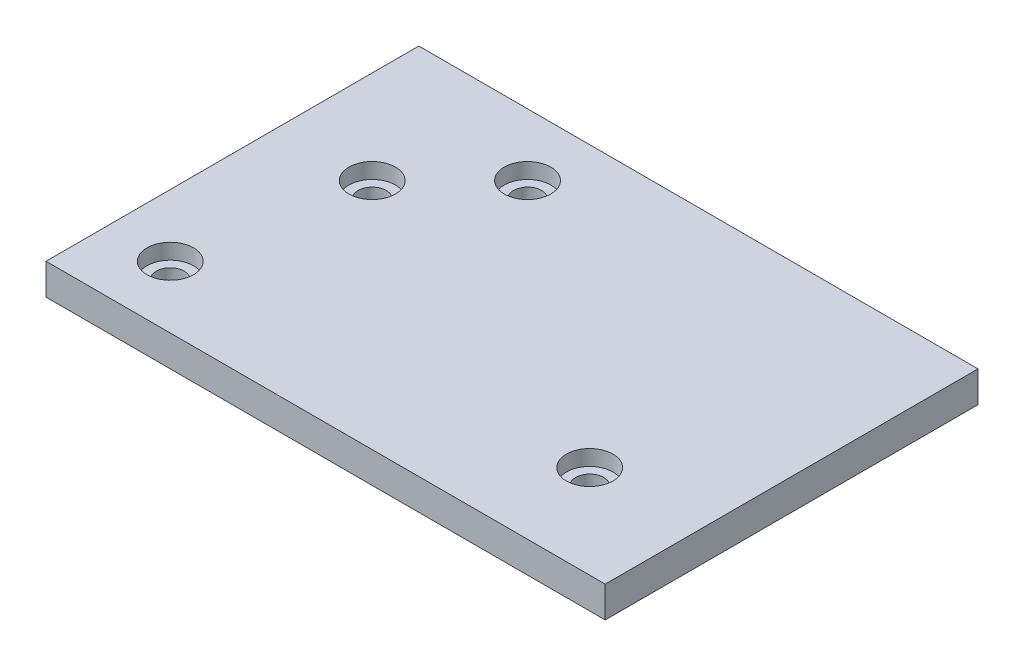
ISO-10303-21;
HEADER;
FILE_DESCRIPTION(('STEP AP214'),'2;1');
FILE_NAME('part.step','',(''),(''),'','','');
FILE_SCHEMA(('AUTOMOTIVE_DESIGN { 1 0 10303 214 1 1 1 1 }'));
ENDSEC;
DATA;
#1=APPLICATION_CONTEXT('core data for automotive mechanical design processes');
#2=APPLICATION_PROTOCOL_DEFINITION('international standard','automotive_design',2000,#1);
#3=PRODUCT_CONTEXT('',#1,'mechanical');
#4=PRODUCT('Part','Part','',(#3));
#5=PRODUCT_RELATED_PRODUCT_CATEGORY('part','',(#4));
#6=PRODUCT_DEFINITION_FORMATION('','',#4);
#7=PRODUCT_DEFINITION_CONTEXT('part definition',#1,'design');
#8=PRODUCT_DEFINITION('design','',#6,#7);
#9=PRODUCT_DEFINITION_SHAPE('','',#8);
#10=(LENGTH_UNIT() NAMED_UNIT(*) SI_UNIT(.MILLI.,.METRE.));
#11=(NAMED_UNIT(*) PLANE_ANGLE_UNIT() SI_UNIT($,.RADIAN.));
#12=(NAMED_UNIT(*) SI_UNIT($,.STERADIAN.) SOLID_ANGLE_UNIT());
#13=UNCERTAINTY_MEASURE_WITH_UNIT(LENGTH_MEASURE(1.E-05),#10,'distance_accuracy_value','');
#14=(GEOMETRIC_REPRESENTATION_CONTEXT(3) GLOBAL_UNCERTAINTY_ASSIGNED_CONTEXT((#13)) GLOBAL_UNIT_ASSIGNED_CONTEXT((#10,
#11,#12)) REPRESENTATION_CONTEXT('',''));
#15=CARTESIAN_POINT('',(0.,0.,0.));
#16=DIRECTION('',(0.,0.,1.));
#17=DIRECTION('',(1.,0.,0.));
#18=AXIS2_PLACEMENT_3D('',#15,#16,#17);
#19=CARTESIAN_POINT('',(55.,0.,30.));
#20=DIRECTION('',(0.,1.,0.));
#21=DIRECTION('',(0.,0.,1.));
#22=AXIS2_PLACEMENT_3D('',#19,#20,#21);
#23=CYLINDRICAL_SURFACE('',#22,7.50000000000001);
#24=CARTESIAN_POINT('',(55.,0.,30.));
#25=DIRECTION('',(0.,1.,0.));
#26=DIRECTION('',(0.,0.,1.));
#27=AXIS2_PLACEMENT_3D('',#24,#25,#26);
#28=CIRCLE('',#27,7.50000000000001);
#29=CARTESIAN_POINT('',(55.,0.,37.5));
#30=VERTEX_POINT('',#29);
#31=EDGE_CURVE('E36',#30,#30,#28,.T.);
#32=ORIENTED_EDGE('',*,*,#31,.F.);
#33=EDGE_LOOP('',(#32));
#34=FACE_BOUND('',#33,.T.);
#35=CARTESIAN_POINT('',(55.,5.,30.));
#36=DIRECTION('',(0.,1.,0.));
#37=DIRECTION('',(0.,0.,1.));
#38=AXIS2_PLACEMENT_3D('',#35,#36,#37);
#39=CIRCLE('',#38,7.50000000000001);
#40=CARTESIAN_POINT('',(55.,5.,37.5));
#41=VERTEX_POINT('',#40);
#42=EDGE_CURVE('E11',#41,#41,#39,.T.);
#43=ORIENTED_EDGE('',*,*,#42,.T.);
#44=EDGE_LOOP('',(#43));
#45=FACE_BOUND('',#44,.T.);
#46=ADVANCED_FACE('F29',(#34,#45),#23,.F.);
#47=CARTESIAN_POINT('',(55.,0.,30.));
#48=DIRECTION('',(0.,1.,0.));
#49=DIRECTION('',(0.,0.,1.));
#50=AXIS2_PLACEMENT_3D('',#47,#48,#49);
#51=PLANE('',#50);
#52=ORIENTED_EDGE('',*,*,#31,.T.);
#53=EDGE_LOOP('',(#52));
#54=FACE_BOUND('',#53,.T.);
#55=CARTESIAN_POINT('',(55.,0.,30.));
#56=DIRECTION('',(0.,1.,0.));
#57=DIRECTION('',(0.,0.,1.));
#58=AXIS2_PLACEMENT_3D('',#55,#56,#57);
#59=CIRCLE('',#58,4.50000000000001);
#60=CARTESIAN_POINT('',(55.,0.,34.5));
#61=VERTEX_POINT('',#60);
#62=EDGE_CURVE('E141',#61,#61,#59,.F.);
#63=ORIENTED_EDGE('',*,*,#62,.T.);
#64=EDGE_LOOP('',(#63));
#65=FACE_BOUND('',#64,.T.);
#66=ADVANCED_FACE('F146',(#54,#65),#51,.T.);
#67=CARTESIAN_POINT('',(55.,-5.001,30.));
#68=DIRECTION('',(0.,1.,0.));
#69=DIRECTION('',(0.,0.,1.));
#70=AXIS2_PLACEMENT_3D('',#67,#68,#69);
#71=CYLINDRICAL_SURFACE('',#70,4.50000000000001);
#72=CARTESIAN_POINT('',(55.,-5.,30.));
#73=DIRECTION('',(0.,-1.,0.));
#74=DIRECTION('',(0.,0.,-1.));
#75=AXIS2_PLACEMENT_3D('',#72,#73,#74);
#76=CIRCLE('',#75,4.50000000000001);
#77=CARTESIAN_POINT('',(55.,-5.,25.5));
#78=VERTEX_POINT('',#77);
#79=EDGE_CURVE('E138',#78,#78,#76,.F.);
#80=ORIENTED_EDGE('',*,*,#79,.F.);
#81=EDGE_LOOP('',(#80));
#82=FACE_BOUND('',#81,.T.);
#83=ORIENTED_EDGE('',*,*,#62,.F.);
#84=EDGE_LOOP('',(#83));
#85=FACE_BOUND('',#84,.T.);
#86=ADVANCED_FACE('F207',(#82,#85),#71,.F.);
#87=CARTESIAN_POINT('',(-35.,0.,-40.));
#88=DIRECTION('',(0.,1.,0.));
#89=DIRECTION('',(0.,0.,1.));
#90=AXIS2_PLACEMENT_3D('',#87,#88,#89);
#91=CYLINDRICAL_SURFACE('',#90,7.50000000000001);
#92=CARTESIAN_POINT('',(-35.,0.,-40.));
#93=DIRECTION('',(0.,1.,0.));
#94=DIRECTION('',(0.,0.,1.));
#95=AXIS2_PLACEMENT_3D('',#92,#93,#94);
#96=CIRCLE('',#95,7.50000000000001);
#97=CARTESIAN_POINT('',(-35.,0.,-32.5));
#98=VERTEX_POINT('',#97);
#99=EDGE_CURVE('E132',#98,#98,#96,.T.);
#100=ORIENTED_EDGE('',*,*,#99,.F.);
#101=EDGE_LOOP('',(#100));
#102=FACE_BOUND('',#101,.T.);
#103=CARTESIAN_POINT('',(-35.,5.,-40.));
#104=DIRECTION('',(0.,1.,0.));
#105=DIRECTION('',(0.,0.,1.));
#106=AXIS2_PLACEMENT_3D('',#103,#104,#105);
#107=CIRCLE('',#106,7.50000000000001);
#108=CARTESIAN_POINT('',(-35.,5.,-32.5));
#109=VERTEX_POINT('',#108);
#110=EDGE_CURVE('E135',#109,#109,#107,.T.);
#111=ORIENTED_EDGE('',*,*,#110,.T.);
#112=EDGE_LOOP('',(#111));
#113=FACE_BOUND('',#112,.T.);
#114=ADVANCED_FACE('F203',(#102,#113),#91,.F.);
#115=CARTESIAN_POINT('',(-35.,0.,-40.));
#116=DIRECTION('',(0.,1.,0.));
#117=DIRECTION('',(0.,0.,1.));
#118=AXIS2_PLACEMENT_3D('',#115,#116,#117);
#119=PLANE('',#118);
#120=ORIENTED_EDGE('',*,*,#99,.T.);
#121=EDGE_LOOP('',(#120));
#122=FACE_BOUND('',#121,.T.);
#123=CARTESIAN_POINT('',(-35.,0.,-40.));
#124=DIRECTION('',(0.,1.,0.));
#125=DIRECTION('',(0.,0.,1.));
#126=AXIS2_PLACEMENT_3D('',#123,#124,#125);
#127=CIRCLE('',#126,4.50000000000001);
#128=CARTESIAN_POINT('',(-35.,0.,-35.5));
#129=VERTEX_POINT('',#128);
#130=EDGE_CURVE('E129',#129,#129,#127,.F.);
#131=ORIENTED_EDGE('',*,*,#130,.T.);
#132=EDGE_LOOP('',(#131));
#133=FACE_BOUND('',#132,.T.);
#134=ADVANCED_FACE('F199',(#122,#133),#119,.T.);
#135=CARTESIAN_POINT('',(-35.,-5.001,-40.));
#136=DIRECTION('',(0.,1.,0.));
#137=DIRECTION('',(0.,0.,1.));
#138=AXIS2_PLACEMENT_3D('',#135,#136,#137);
#139=CYLINDRICAL_SURFACE('',#138,4.50000000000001);
#140=CARTESIAN_POINT('',(-35.,-5.,-40.));
#141=DIRECTION('',(0.,-1.,0.));
#142=DIRECTION('',(0.,0.,-1.));
#143=AXIS2_PLACEMENT_3D('',#140,#141,#142);
#144=CIRCLE('',#143,4.50000000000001);
#145=CARTESIAN_POINT('',(-35.,-5.,-44.5));
#146=VERTEX_POINT('',#145);
#147=EDGE_CURVE('E126',#146,#146,#144,.F.);
#148=ORIENTED_EDGE('',*,*,#147,.F.);
#149=EDGE_LOOP('',(#148));
#150=FACE_BOUND('',#149,.T.);
#151=ORIENTED_EDGE('',*,*,#130,.F.);
#152=EDGE_LOOP('',(#151));
#153=FACE_BOUND('',#152,.T.);
#154=ADVANCED_FACE('F195',(#150,#153),#139,.F.);
#155=CARTESIAN_POINT('',(-60.,0.,-15.));
#156=DIRECTION('',(0.,1.,0.));
#157=DIRECTION('',(0.,0.,1.));
#158=AXIS2_PLACEMENT_3D('',#155,#156,#157);
#159=CYLINDRICAL_SURFACE('',#158,7.50000000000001);
#160=CARTESIAN_POINT('',(-60.,0.,-15.));
#161=DIRECTION('',(0.,1.,0.));
#162=DIRECTION('',(0.,0.,1.));
#163=AXIS2_PLACEMENT_3D('',#160,#161,#162);
#164=CIRCLE('',#163,7.50000000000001);
#165=CARTESIAN_POINT('',(-60.,0.,-7.49999999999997));
#166=VERTEX_POINT('',#165);
#167=EDGE_CURVE('E120',#166,#166,#164,.T.);
#168=ORIENTED_EDGE('',*,*,#167,.F.);
#169=EDGE_LOOP('',(#168));
#170=FACE_BOUND('',#169,.T.);
#171=CARTESIAN_POINT('',(-60.,5.,-15.));
#172=DIRECTION('',(0.,1.,0.));
#173=DIRECTION('',(0.,0.,1.));
#174=AXIS2_PLACEMENT_3D('',#171,#172,#173);
#175=CIRCLE('',#174,7.50000000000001);
#176=CARTESIAN_POINT('',(-60.,5.,-7.49999999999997));
#177=VERTEX_POINT('',#176);
#178=EDGE_CURVE('E123',#177,#177,#175,.T.);
#179=ORIENTED_EDGE('',*,*,#178,.T.);
#180=EDGE_LOOP('',(#179));
#181=FACE_BOUND('',#180,.T.);
#182=ADVANCED_FACE('F191',(#170,#181),#159,.F.);
#183=CARTESIAN_POINT('',(-60.,0.,-15.));
#184=DIRECTION('',(0.,1.,0.));
#185=DIRECTION('',(0.,0.,1.));
#186=AXIS2_PLACEMENT_3D('',#183,#184,#185);
#187=PLANE('',#186);
#188=ORIENTED_EDGE('',*,*,#167,.T.);
#189=EDGE_LOOP('',(#188));
#190=FACE_BOUND('',#189,.T.);
#191=CARTESIAN_POINT('',(-60.,0.,-15.));
#192=DIRECTION('',(0.,1.,0.));
#193=DIRECTION('',(0.,0.,1.));
#194=AXIS2_PLACEMENT_3D('',#191,#192,#193);
#195=CIRCLE('',#194,4.50000000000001);
#196=CARTESIAN_POINT('',(-60.,0.,-10.5));
#197=VERTEX_POINT('',#196);
#198=EDGE_CURVE('E117',#197,#197,#195,.F.);
#199=ORIENTED_EDGE('',*,*,#198,.T.);
#200=EDGE_LOOP('',(#199));
#201=FACE_BOUND('',#200,.T.);
#202=ADVANCED_FACE('F187',(#190,#201),#187,.T.);
#203=CARTESIAN_POINT('',(-60.,-5.001,-15.));
#204=DIRECTION('',(0.,1.,0.));
#205=DIRECTION('',(0.,0.,1.));
#206=AXIS2_PLACEMENT_3D('',#203,#204,#205);
#207=CYLINDRICAL_SURFACE('',#206,4.50000000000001);
#208=CARTESIAN_POINT('',(-60.,-5.,-15.));
#209=DIRECTION('',(0.,-1.,0.));
#210=DIRECTION('',(0.,0.,-1.));
#211=AXIS2_PLACEMENT_3D('',#208,#209,#210);
#212=CIRCLE('',#211,4.50000000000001);
#213=CARTESIAN_POINT('',(-60.,-5.,-19.5));
#214=VERTEX_POINT('',#213);
#215=EDGE_CURVE('E86',#214,#214,#212,.F.);
#216=ORIENTED_EDGE('',*,*,#215,.F.);
#217=EDGE_LOOP('',(#216));
#218=FACE_BOUND('',#217,.T.);
#219=ORIENTED_EDGE('',*,*,#198,.F.);
#220=EDGE_LOOP('',(#219));
#221=FACE_BOUND('',#220,.T.);
#222=ADVANCED_FACE('F184',(#218,#221),#207,.F.);
#223=CARTESIAN_POINT('',(-70.,-5.001,40.));
#224=DIRECTION('',(0.,1.,0.));
#225=DIRECTION('',(0.,0.,1.));
#226=AXIS2_PLACEMENT_3D('',#223,#224,#225);
#227=CYLINDRICAL_SURFACE('',#226,4.50000000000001);
#228=CARTESIAN_POINT('',(-70.,-5.,40.));
#229=DIRECTION('',(0.,-1.,0.));
#230=DIRECTION('',(0.,0.,-1.));
#231=AXIS2_PLACEMENT_3D('',#228,#229,#230);
#232=CIRCLE('',#231,4.50000000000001);
#233=CARTESIAN_POINT('',(-70.,-5.,35.5));
#234=VERTEX_POINT('',#233);
#235=EDGE_CURVE('E92',#234,#234,#232,.F.);
#236=ORIENTED_EDGE('',*,*,#235,.F.);
#237=EDGE_LOOP('',(#236));
#238=FACE_BOUND('',#237,.T.);
#239=CARTESIAN_POINT('',(-70.,0.,40.));
#240=DIRECTION('',(0.,1.,0.));
#241=DIRECTION('',(0.,0.,1.));
#242=AXIS2_PLACEMENT_3D('',#239,#240,#241);
#243=CIRCLE('',#242,4.50000000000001);
#244=CARTESIAN_POINT('',(-70.,0.,44.5));
#245=VERTEX_POINT('',#244);
#246=EDGE_CURVE('E95',#245,#245,#243,.F.);
#247=ORIENTED_EDGE('',*,*,#246,.F.);
#248=EDGE_LOOP('',(#247));
#249=FACE_BOUND('',#248,.T.);
#250=ADVANCED_FACE('F183',(#238,#249),#227,.F.);
#251=CARTESIAN_POINT('',(90.,5.,-60.));
#252=DIRECTION('',(-1.,0.,0.));
#253=DIRECTION('',(0.,0.,1.));
#254=AXIS2_PLACEMENT_3D('',#251,#252,#253);
#255=PLANE('',#254);
#256=DIRECTION('',(0.,0.,-1.));
#257=VECTOR('',#256,1.);
#258=CARTESIAN_POINT('',(90.,-5.,-60.));
#259=LINE('',#258,#257);
#260=CARTESIAN_POINT('',(90.,-5.,60.));
#261=VERTEX_POINT('',#260);
#262=CARTESIAN_POINT('',(90.,-5.,-60.));
#263=VERTEX_POINT('',#262);
#264=EDGE_CURVE('E74',#261,#263,#259,.T.);
#265=ORIENTED_EDGE('',*,*,#264,.T.);
#266=DIRECTION('',(0.,-1.,0.));
#267=VECTOR('',#266,1.);
#268=CARTESIAN_POINT('',(90.,5.,-60.));
#269=LINE('',#268,#267);
#270=CARTESIAN_POINT('',(90.,5.,-60.));
#271=VERTEX_POINT('',#270);
#272=EDGE_CURVE('E81',#271,#263,#269,.T.);
#273=ORIENTED_EDGE('',*,*,#272,.F.);
#274=DIRECTION('',(0.,0.,-1.));
#275=VECTOR('',#274,1.);
#276=CARTESIAN_POINT('',(90.,5.,-60.));
#277=LINE('',#276,#275);
#278=CARTESIAN_POINT('',(90.,5.,60.));
#279=VERTEX_POINT('',#278);
#280=EDGE_CURVE('E102',#279,#271,#277,.T.);
#281=ORIENTED_EDGE('',*,*,#280,.F.);
#282=DIRECTION('',(0.,-1.,0.));
#283=VECTOR('',#282,1.);
#284=CARTESIAN_POINT('',(90.,5.,60.));
#285=LINE('',#284,#283);
#286=EDGE_CURVE('E91',#279,#261,#285,.T.);
#287=ORIENTED_EDGE('',*,*,#286,.T.);
#288=EDGE_LOOP('',(#265,#273,#281,#287));
#289=FACE_BOUND('',#288,.T.);
#290=ADVANCED_FACE('F90',(#289),#255,.F.);
#291=CARTESIAN_POINT('',(90.,5.,-60.));
#292=DIRECTION('',(0.,0.,1.));
#293=DIRECTION('',(1.,0.,0.));
#294=AXIS2_PLACEMENT_3D('',#291,#292,#293);
#295=PLANE('',#294);
#296=DIRECTION('',(-1.,0.,0.));
#297=VECTOR('',#296,1.);
#298=CARTESIAN_POINT('',(90.,-5.,-60.));
#299=LINE('',#298,#297);
#300=CARTESIAN_POINT('',(-90.,-5.,-60.));
#301=VERTEX_POINT('',#300);
#302=EDGE_CURVE('E69',#263,#301,#299,.T.);
#303=ORIENTED_EDGE('',*,*,#302,.T.);
#304=DIRECTION('',(0.,-1.,0.));
#305=VECTOR('',#304,1.);
#306=CARTESIAN_POINT('',(-90.,5.,-60.));
#307=LINE('',#306,#305);
#308=CARTESIAN_POINT('',(-90.,5.,-60.));
#309=VERTEX_POINT('',#308);
#310=EDGE_CURVE('E87',#309,#301,#307,.T.);
#311=ORIENTED_EDGE('',*,*,#310,.F.);
#312=DIRECTION('',(-1.,0.,0.));
#313=VECTOR('',#312,1.);
#314=CARTESIAN_POINT('',(90.,5.,-60.));
#315=LINE('',#314,#313);
#316=EDGE_CURVE('E83',#271,#309,#315,.T.);
#317=ORIENTED_EDGE('',*,*,#316,.F.);
#318=ORIENTED_EDGE('',*,*,#272,.T.);
#319=EDGE_LOOP('',(#303,#311,#317,#318));
#320=FACE_BOUND('',#319,.T.);
#321=ADVANCED_FACE('F82',(#320),#295,.F.);
#322=CARTESIAN_POINT('',(-90.,5.,-60.));
#323=DIRECTION('',(1.,0.,0.));
#324=DIRECTION('',(0.,0.,-1.));
#325=AXIS2_PLACEMENT_3D('',#322,#323,#324);
#326=PLANE('',#325);
#327=DIRECTION('',(0.,0.,1.));
#328=VECTOR('',#327,1.);
#329=CARTESIAN_POINT('',(-90.,-5.,-60.));
#330=LINE('',#329,#328);
#331=CARTESIAN_POINT('',(-90.,-5.,60.));
#332=VERTEX_POINT('',#331);
#333=EDGE_CURVE('E75',#301,#332,#330,.T.);
#334=ORIENTED_EDGE('',*,*,#333,.T.);
#335=DIRECTION('',(0.,-1.,0.));
#336=VECTOR('',#335,1.);
#337=CARTESIAN_POINT('',(-90.,5.,60.));
#338=LINE('',#337,#336);
#339=CARTESIAN_POINT('',(-90.,5.,60.));
#340=VERTEX_POINT('',#339);
#341=EDGE_CURVE('E108',#340,#332,#338,.T.);
#342=ORIENTED_EDGE('',*,*,#341,.F.);
#343=DIRECTION('',(0.,0.,1.));
#344=VECTOR('',#343,1.);
#345=CARTESIAN_POINT('',(-90.,5.,-60.));
#346=LINE('',#345,#344);
#347=EDGE_CURVE('E48',#309,#340,#346,.T.);
#348=ORIENTED_EDGE('',*,*,#347,.F.);
#349=ORIENTED_EDGE('',*,*,#310,.T.);
#350=EDGE_LOOP('',(#334,#342,#348,#349));
#351=FACE_BOUND('',#350,.T.);
#352=ADVANCED_FACE('F166',(#351),#326,.F.);
#353=CARTESIAN_POINT('',(90.,5.,60.));
#354=DIRECTION('',(0.,0.,-1.));
#355=DIRECTION('',(-1.,0.,0.));
#356=AXIS2_PLACEMENT_3D('',#353,#354,#355);
#357=PLANE('',#356);
#358=DIRECTION('',(1.,0.,0.));
#359=VECTOR('',#358,1.);
#360=CARTESIAN_POINT('',(90.,-5.,60.));
#361=LINE('',#360,#359);
#362=EDGE_CURVE('E100',#332,#261,#361,.T.);
#363=ORIENTED_EDGE('',*,*,#362,.T.);
#364=ORIENTED_EDGE('',*,*,#286,.F.);
#365=DIRECTION('',(1.,0.,0.));
#366=VECTOR('',#365,1.);
#367=CARTESIAN_POINT('',(90.,5.,60.));
#368=LINE('',#367,#366);
#369=EDGE_CURVE('E43',#340,#279,#368,.T.);
#370=ORIENTED_EDGE('',*,*,#369,.F.);
#371=ORIENTED_EDGE('',*,*,#341,.T.);
#372=EDGE_LOOP('',(#363,#364,#370,#371));
#373=FACE_BOUND('',#372,.T.);
#374=ADVANCED_FACE('F156',(#373),#357,.F.);
#375=CARTESIAN_POINT('',(90.,5.,60.));
#376=DIRECTION('',(0.,-1.,0.));
#377=DIRECTION('',(0.,0.,-1.));
#378=AXIS2_PLACEMENT_3D('',#375,#376,#377);
#379=PLANE('',#378);
#380=ORIENTED_EDGE('',*,*,#42,.F.);
#381=EDGE_LOOP('',(#380));
#382=FACE_BOUND('',#381,.T.);
#383=ORIENTED_EDGE('',*,*,#110,.F.);
#384=EDGE_LOOP('',(#383));
#385=FACE_BOUND('',#384,.T.);
#386=ORIENTED_EDGE('',*,*,#178,.F.);
#387=EDGE_LOOP('',(#386));
#388=FACE_BOUND('',#387,.T.);
#389=CARTESIAN_POINT('',(-70.,5.,40.));
#390=DIRECTION('',(0.,1.,0.));
#391=DIRECTION('',(0.,0.,1.));
#392=AXIS2_PLACEMENT_3D('',#389,#390,#391);
#393=CIRCLE('',#392,7.50000000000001);
#394=CARTESIAN_POINT('',(-70.,5.,47.5));
#395=VERTEX_POINT('',#394);
#396=EDGE_CURVE('E164',#395,#395,#393,.T.);
#397=ORIENTED_EDGE('',*,*,#396,.F.);
#398=EDGE_LOOP('',(#397));
#399=FACE_BOUND('',#398,.T.);
#400=ORIENTED_EDGE('',*,*,#280,.T.);
#401=ORIENTED_EDGE('',*,*,#316,.T.);
#402=ORIENTED_EDGE('',*,*,#347,.T.);
#403=ORIENTED_EDGE('',*,*,#369,.T.);
#404=EDGE_LOOP('',(#400,#401,#402,#403));
#405=FACE_BOUND('',#404,.T.);
#406=ADVANCED_FACE('F153',(#382,#385,#388,#399,#405),#379,.F.);
#407=CARTESIAN_POINT('',(90.,-5.,60.));
#408=DIRECTION('',(0.,-1.,0.));
#409=DIRECTION('',(0.,0.,-1.));
#410=AXIS2_PLACEMENT_3D('',#407,#408,#409);
#411=PLANE('',#410);
#412=ORIENTED_EDGE('',*,*,#79,.T.);
#413=EDGE_LOOP('',(#412));
#414=FACE_BOUND('',#413,.T.);
#415=ORIENTED_EDGE('',*,*,#147,.T.);
#416=EDGE_LOOP('',(#415));
#417=FACE_BOUND('',#416,.T.);
#418=ORIENTED_EDGE('',*,*,#215,.T.);
#419=EDGE_LOOP('',(#418));
#420=FACE_BOUND('',#419,.T.);
#421=ORIENTED_EDGE('',*,*,#235,.T.);
#422=EDGE_LOOP('',(#421));
#423=FACE_BOUND('',#422,.T.);
#424=ORIENTED_EDGE('',*,*,#264,.F.);
#425=ORIENTED_EDGE('',*,*,#362,.F.);
#426=ORIENTED_EDGE('',*,*,#333,.F.);
#427=ORIENTED_EDGE('',*,*,#302,.F.);
#428=EDGE_LOOP('',(#424,#425,#426,#427));
#429=FACE_BOUND('',#428,.T.);
#430=ADVANCED_FACE('F71',(#414,#417,#420,#423,#429),#411,.T.);
#431=CARTESIAN_POINT('',(-70.,0.,40.));
#432=DIRECTION('',(0.,1.,0.));
#433=DIRECTION('',(0.,0.,1.));
#434=AXIS2_PLACEMENT_3D('',#431,#432,#433);
#435=PLANE('',#434);
#436=CARTESIAN_POINT('',(-70.,0.,40.));
#437=DIRECTION('',(0.,1.,0.));
#438=DIRECTION('',(0.,0.,1.));
#439=AXIS2_PLACEMENT_3D('',#436,#437,#438);
#440=CIRCLE('',#439,7.50000000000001);
#441=CARTESIAN_POINT('',(-70.,0.,47.5));
#442=VERTEX_POINT('',#441);
#443=EDGE_CURVE('E114',#442,#442,#440,.T.);
#444=ORIENTED_EDGE('',*,*,#443,.T.);
#445=EDGE_LOOP('',(#444));
#446=FACE_BOUND('',#445,.T.);
#447=ORIENTED_EDGE('',*,*,#246,.T.);
#448=EDGE_LOOP('',(#447));
#449=FACE_BOUND('',#448,.T.);
#450=ADVANCED_FACE('F253',(#446,#449),#435,.T.);
#451=CARTESIAN_POINT('',(-70.,0.,40.));
#452=DIRECTION('',(0.,1.,0.));
#453=DIRECTION('',(0.,0.,1.));
#454=AXIS2_PLACEMENT_3D('',#451,#452,#453);
#455=CYLINDRICAL_SURFACE('',#454,7.50000000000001);
#456=ORIENTED_EDGE('',*,*,#443,.F.);
#457=EDGE_LOOP('',(#456));
#458=FACE_BOUND('',#457,.T.);
#459=ORIENTED_EDGE('',*,*,#396,.T.);
#460=EDGE_LOOP('',(#459));
#461=FACE_BOUND('',#460,.T.);
#462=ADVANCED_FACE('F258',(#458,#461),#455,.F.);
#463=CLOSED_SHELL('',(#46,#66,#86,#114,#134,#154,#182,#202,#222,#250,#290,#321,#352,#374,#406,
#430,#450,#462));
#464=MANIFOLD_SOLID_BREP('B2',#463);
#465=ADVANCED_BREP_SHAPE_REPRESENTATION('',(#18,#464),#14);
#466=SHAPE_DEFINITION_REPRESENTATION(#9,#465);
ENDSEC;
END-ISO-10303-21;
